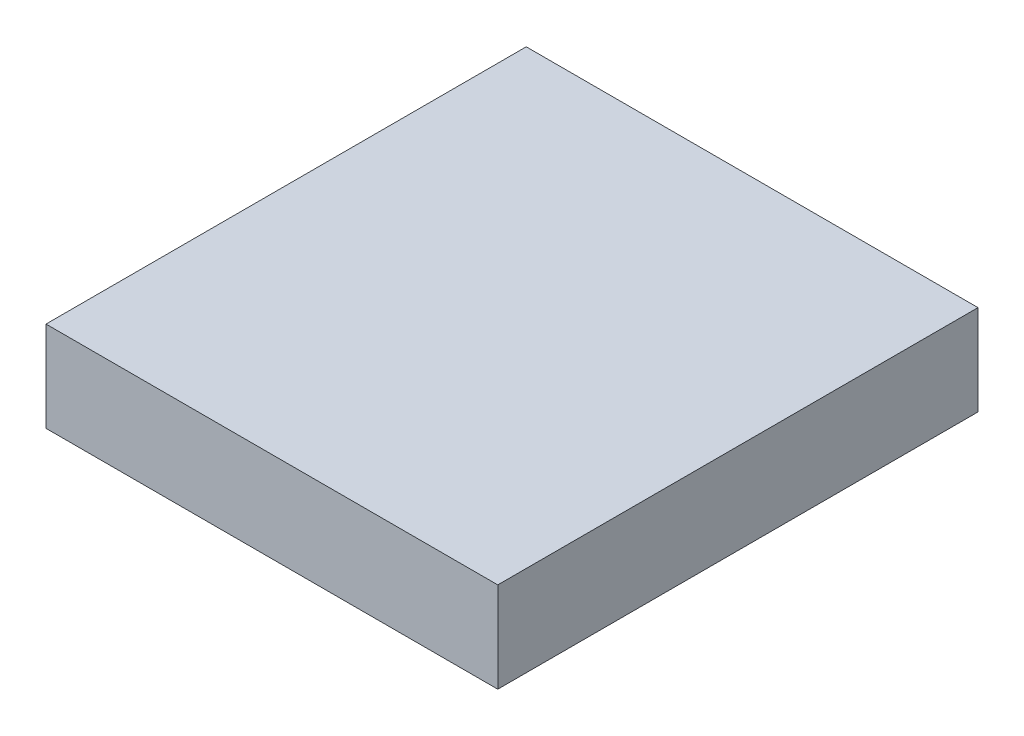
ISO-10303-21;
HEADER;
FILE_DESCRIPTION(('STEP AP214'),'2;1');
FILE_NAME('part.step','',(''),(''),'','','');
FILE_SCHEMA(('AUTOMOTIVE_DESIGN { 1 0 10303 214 1 1 1 1 }'));
ENDSEC;
DATA;
#1=APPLICATION_CONTEXT('core data for automotive mechanical design processes');
#2=APPLICATION_PROTOCOL_DEFINITION('international standard','automotive_design',2000,#1);
#3=PRODUCT_CONTEXT('',#1,'mechanical');
#4=PRODUCT('Part','Part','',(#3));
#5=PRODUCT_RELATED_PRODUCT_CATEGORY('part','',(#4));
#6=PRODUCT_DEFINITION_FORMATION('','',#4);
#7=PRODUCT_DEFINITION_CONTEXT('part definition',#1,'design');
#8=PRODUCT_DEFINITION('design','',#6,#7);
#9=PRODUCT_DEFINITION_SHAPE('','',#8);
#10=(LENGTH_UNIT() NAMED_UNIT(*) SI_UNIT(.MILLI.,.METRE.));
#11=(NAMED_UNIT(*) PLANE_ANGLE_UNIT() SI_UNIT($,.RADIAN.));
#12=(NAMED_UNIT(*) SI_UNIT($,.STERADIAN.) SOLID_ANGLE_UNIT());
#13=UNCERTAINTY_MEASURE_WITH_UNIT(LENGTH_MEASURE(1.E-05),#10,'distance_accuracy_value','');
#14=(GEOMETRIC_REPRESENTATION_CONTEXT(3) GLOBAL_UNCERTAINTY_ASSIGNED_CONTEXT((#13)) GLOBAL_UNIT_ASSIGNED_CONTEXT((#10,
#11,#12)) REPRESENTATION_CONTEXT('',''));
#15=CARTESIAN_POINT('',(0.,0.,0.));
#16=DIRECTION('',(0.,0.,1.));
#17=DIRECTION('',(1.,0.,0.));
#18=AXIS2_PLACEMENT_3D('',#15,#16,#17);
#19=CARTESIAN_POINT('',(0.,0.,2.69999968));
#20=DIRECTION('',(0.,0.,-1.));
#21=DIRECTION('',(0.,-1.,0.));
#22=AXIS2_PLACEMENT_3D('',#19,#20,#21);
#23=PLANE('',#22);
#24=DIRECTION('',(1.,0.,0.));
#25=VECTOR('',#24,1.);
#26=CARTESIAN_POINT('',(-1.27,0.254,2.69999968));
#27=LINE('',#26,#25);
#28=CARTESIAN_POINT('',(-1.27,0.254,2.69999968));
#29=VERTEX_POINT('',#28);
#30=CARTESIAN_POINT('',(1.27,0.254,2.69999968));
#31=VERTEX_POINT('',#30);
#32=EDGE_CURVE('E25',#29,#31,#27,.T.);
#33=ORIENTED_EDGE('',*,*,#32,.F.);
#34=DIRECTION('',(0.,1.,0.));
#35=VECTOR('',#34,1.);
#36=CARTESIAN_POINT('',(-1.27,-0.254,2.69999968));
#37=LINE('',#36,#35);
#38=CARTESIAN_POINT('',(-1.27,-0.254,2.69999968));
#39=VERTEX_POINT('',#38);
#40=EDGE_CURVE('E103',#39,#29,#37,.T.);
#41=ORIENTED_EDGE('',*,*,#40,.F.);
#42=DIRECTION('',(-1.,0.,0.));
#43=VECTOR('',#42,1.);
#44=CARTESIAN_POINT('',(1.27,-0.254,2.69999968));
#45=LINE('',#44,#43);
#46=CARTESIAN_POINT('',(1.27,-0.254,2.69999968));
#47=VERTEX_POINT('',#46);
#48=EDGE_CURVE('E83',#47,#39,#45,.T.);
#49=ORIENTED_EDGE('',*,*,#48,.F.);
#50=DIRECTION('',(0.,-1.,0.));
#51=VECTOR('',#50,1.);
#52=CARTESIAN_POINT('',(1.27,0.254,2.69999968));
#53=LINE('',#52,#51);
#54=EDGE_CURVE('E87',#31,#47,#53,.T.);
#55=ORIENTED_EDGE('',*,*,#54,.F.);
#56=EDGE_LOOP('',(#33,#41,#49,#55));
#57=FACE_BOUND('',#56,.T.);
#58=ADVANCED_FACE('F17',(#57),#23,.F.);
#59=CARTESIAN_POINT('',(0.,0.,0.));
#60=DIRECTION('',(0.,0.,-1.));
#61=DIRECTION('',(0.,-1.,0.));
#62=AXIS2_PLACEMENT_3D('',#59,#60,#61);
#63=PLANE('',#62);
#64=DIRECTION('',(0.,-1.,0.));
#65=VECTOR('',#64,1.);
#66=CARTESIAN_POINT('',(1.27,0.254,0.));
#67=LINE('',#66,#65);
#68=CARTESIAN_POINT('',(1.27,0.254,0.));
#69=VERTEX_POINT('',#68);
#70=CARTESIAN_POINT('',(1.27,-0.254,0.));
#71=VERTEX_POINT('',#70);
#72=EDGE_CURVE('E71',#69,#71,#67,.T.);
#73=ORIENTED_EDGE('',*,*,#72,.T.);
#74=DIRECTION('',(-1.,0.,0.));
#75=VECTOR('',#74,1.);
#76=CARTESIAN_POINT('',(1.27,-0.254,0.));
#77=LINE('',#76,#75);
#78=CARTESIAN_POINT('',(-1.27,-0.254,0.));
#79=VERTEX_POINT('',#78);
#80=EDGE_CURVE('E100',#71,#79,#77,.T.);
#81=ORIENTED_EDGE('',*,*,#80,.T.);
#82=DIRECTION('',(0.,1.,0.));
#83=VECTOR('',#82,1.);
#84=CARTESIAN_POINT('',(-1.27,-0.254,0.));
#85=LINE('',#84,#83);
#86=CARTESIAN_POINT('',(-1.27,0.254,0.));
#87=VERTEX_POINT('',#86);
#88=EDGE_CURVE('E73',#79,#87,#85,.T.);
#89=ORIENTED_EDGE('',*,*,#88,.T.);
#90=DIRECTION('',(1.,0.,0.));
#91=VECTOR('',#90,1.);
#92=CARTESIAN_POINT('',(-1.27,0.254,0.));
#93=LINE('',#92,#91);
#94=EDGE_CURVE('E11',#87,#69,#93,.T.);
#95=ORIENTED_EDGE('',*,*,#94,.T.);
#96=EDGE_LOOP('',(#73,#81,#89,#95));
#97=FACE_BOUND('',#96,.T.);
#98=ADVANCED_FACE('F69',(#97),#63,.T.);
#99=CARTESIAN_POINT('',(-1.27,0.254,0.));
#100=DIRECTION('',(0.,1.,0.));
#101=DIRECTION('',(1.,0.,0.));
#102=AXIS2_PLACEMENT_3D('',#99,#100,#101);
#103=PLANE('',#102);
#104=DIRECTION('',(0.,0.,1.));
#105=VECTOR('',#104,1.);
#106=CARTESIAN_POINT('',(-1.27,0.254,0.));
#107=LINE('',#106,#105);
#108=EDGE_CURVE('E98',#87,#29,#107,.T.);
#109=ORIENTED_EDGE('',*,*,#108,.T.);
#110=ORIENTED_EDGE('',*,*,#32,.T.);
#111=DIRECTION('',(0.,0.,1.));
#112=VECTOR('',#111,1.);
#113=CARTESIAN_POINT('',(1.27,0.254,0.));
#114=LINE('',#113,#112);
#115=EDGE_CURVE('E79',#69,#31,#114,.T.);
#116=ORIENTED_EDGE('',*,*,#115,.F.);
#117=ORIENTED_EDGE('',*,*,#94,.F.);
#118=EDGE_LOOP('',(#109,#110,#116,#117));
#119=FACE_BOUND('',#118,.T.);
#120=ADVANCED_FACE('F85',(#119),#103,.T.);
#121=CARTESIAN_POINT('',(-1.27,-0.254,0.));
#122=DIRECTION('',(-1.,0.,0.));
#123=DIRECTION('',(0.,0.,1.));
#124=AXIS2_PLACEMENT_3D('',#121,#122,#123);
#125=PLANE('',#124);
#126=DIRECTION('',(0.,0.,1.));
#127=VECTOR('',#126,1.);
#128=CARTESIAN_POINT('',(-1.27,-0.254,0.));
#129=LINE('',#128,#127);
#130=EDGE_CURVE('E104',#79,#39,#129,.T.);
#131=ORIENTED_EDGE('',*,*,#130,.T.);
#132=ORIENTED_EDGE('',*,*,#40,.T.);
#133=ORIENTED_EDGE('',*,*,#108,.F.);
#134=ORIENTED_EDGE('',*,*,#88,.F.);
#135=EDGE_LOOP('',(#131,#132,#133,#134));
#136=FACE_BOUND('',#135,.T.);
#137=ADVANCED_FACE('F169',(#136),#125,.T.);
#138=CARTESIAN_POINT('',(1.27,-0.254,0.));
#139=DIRECTION('',(0.,-1.,0.));
#140=DIRECTION('',(0.,0.,-1.));
#141=AXIS2_PLACEMENT_3D('',#138,#139,#140);
#142=PLANE('',#141);
#143=DIRECTION('',(0.,0.,1.));
#144=VECTOR('',#143,1.);
#145=CARTESIAN_POINT('',(1.27,-0.254,0.));
#146=LINE('',#145,#144);
#147=EDGE_CURVE('E81',#71,#47,#146,.T.);
#148=ORIENTED_EDGE('',*,*,#147,.T.);
#149=ORIENTED_EDGE('',*,*,#48,.T.);
#150=ORIENTED_EDGE('',*,*,#130,.F.);
#151=ORIENTED_EDGE('',*,*,#80,.F.);
#152=EDGE_LOOP('',(#148,#149,#150,#151));
#153=FACE_BOUND('',#152,.T.);
#154=ADVANCED_FACE('F159',(#153),#142,.T.);
#155=CARTESIAN_POINT('',(1.27,0.254,0.));
#156=DIRECTION('',(1.,0.,0.));
#157=DIRECTION('',(0.,1.,0.));
#158=AXIS2_PLACEMENT_3D('',#155,#156,#157);
#159=PLANE('',#158);
#160=ORIENTED_EDGE('',*,*,#115,.T.);
#161=ORIENTED_EDGE('',*,*,#54,.T.);
#162=ORIENTED_EDGE('',*,*,#147,.F.);
#163=ORIENTED_EDGE('',*,*,#72,.F.);
#164=EDGE_LOOP('',(#160,#161,#162,#163));
#165=FACE_BOUND('',#164,.T.);
#166=ADVANCED_FACE('F77',(#165),#159,.T.);
#167=CLOSED_SHELL('',(#58,#98,#120,#137,#154,#166));
#168=MANIFOLD_SOLID_BREP('B1',#167);
#169=ADVANCED_BREP_SHAPE_REPRESENTATION('',(#18,#168),#14);
#170=SHAPE_DEFINITION_REPRESENTATION(#9,#169);
ENDSEC;
END-ISO-10303-21;
